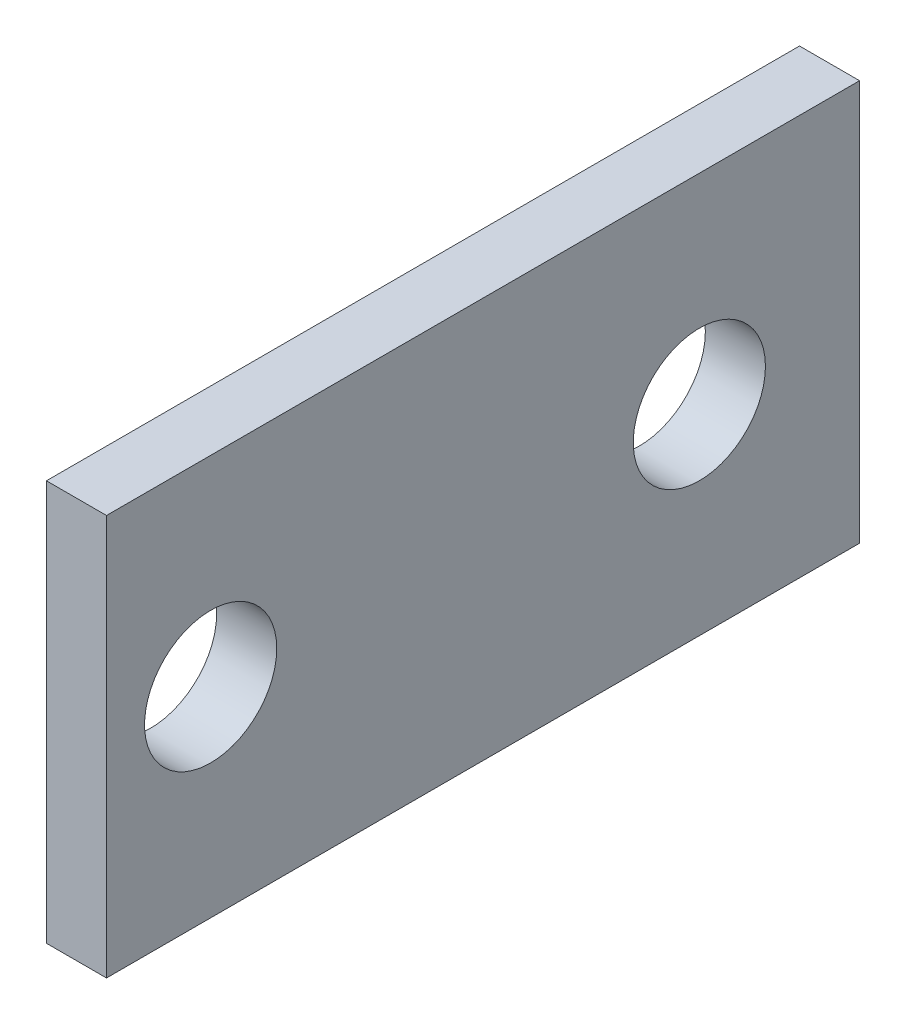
ISO-10303-21;
HEADER;
FILE_DESCRIPTION(('STEP AP214'),'2;1');
FILE_NAME('part.step','',(''),(''),'','','');
FILE_SCHEMA(('AUTOMOTIVE_DESIGN { 1 0 10303 214 1 1 1 1 }'));
ENDSEC;
DATA;
#1=APPLICATION_CONTEXT('core data for automotive mechanical design processes');
#2=APPLICATION_PROTOCOL_DEFINITION('international standard','automotive_design',2000,#1);
#3=PRODUCT_CONTEXT('',#1,'mechanical');
#4=PRODUCT('Part','Part','',(#3));
#5=PRODUCT_RELATED_PRODUCT_CATEGORY('part','',(#4));
#6=PRODUCT_DEFINITION_FORMATION('','',#4);
#7=PRODUCT_DEFINITION_CONTEXT('part definition',#1,'design');
#8=PRODUCT_DEFINITION('design','',#6,#7);
#9=PRODUCT_DEFINITION_SHAPE('','',#8);
#10=(LENGTH_UNIT() NAMED_UNIT(*) SI_UNIT(.MILLI.,.METRE.));
#11=(NAMED_UNIT(*) PLANE_ANGLE_UNIT() SI_UNIT($,.RADIAN.));
#12=(NAMED_UNIT(*) SI_UNIT($,.STERADIAN.) SOLID_ANGLE_UNIT());
#13=UNCERTAINTY_MEASURE_WITH_UNIT(LENGTH_MEASURE(1.E-05),#10,'distance_accuracy_value','');
#14=(GEOMETRIC_REPRESENTATION_CONTEXT(3) GLOBAL_UNCERTAINTY_ASSIGNED_CONTEXT((#13)) GLOBAL_UNIT_ASSIGNED_CONTEXT((#10,
#11,#12)) REPRESENTATION_CONTEXT('',''));
#15=CARTESIAN_POINT('',(0.,0.,0.));
#16=DIRECTION('',(0.,0.,1.));
#17=DIRECTION('',(1.,0.,0.));
#18=AXIS2_PLACEMENT_3D('',#15,#16,#17);
#19=CARTESIAN_POINT('',(1.5,0.,0.));
#20=DIRECTION('',(1.,0.,0.));
#21=DIRECTION('',(0.,0.,-1.));
#22=AXIS2_PLACEMENT_3D('',#19,#20,#21);
#23=PLANE('',#22);
#24=CARTESIAN_POINT('',(1.5,-3.49321550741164,15.0154963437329));
#25=DIRECTION('',(1.,0.,0.));
#26=DIRECTION('',(0.,0.,-1.));
#27=AXIS2_PLACEMENT_3D('',#24,#25,#26);
#28=CIRCLE('',#27,1.65);
#29=CARTESIAN_POINT('',(1.5,-3.49321550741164,13.3654963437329));
#30=VERTEX_POINT('',#29);
#31=EDGE_CURVE('E102',#30,#30,#28,.T.);
#32=ORIENTED_EDGE('',*,*,#31,.F.);
#33=EDGE_LOOP('',(#32));
#34=FACE_BOUND('',#33,.T.);
#35=DIRECTION('',(0.,-1.,0.));
#36=VECTOR('',#35,1.);
#37=CARTESIAN_POINT('',(1.5,1.50678449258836,17.6154963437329));
#38=LINE('',#37,#36);
#39=CARTESIAN_POINT('',(1.5,1.50678449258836,17.6154963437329));
#40=VERTEX_POINT('',#39);
#41=CARTESIAN_POINT('',(1.5,-8.49321550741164,17.6154963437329));
#42=VERTEX_POINT('',#41);
#43=EDGE_CURVE('E87',#40,#42,#38,.T.);
#44=ORIENTED_EDGE('',*,*,#43,.T.);
#45=DIRECTION('',(0.,0.,-1.));
#46=VECTOR('',#45,1.);
#47=CARTESIAN_POINT('',(1.5,-8.49321550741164,17.6154963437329));
#48=LINE('',#47,#46);
#49=CARTESIAN_POINT('',(1.5,-8.49321550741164,-1.18450365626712));
#50=VERTEX_POINT('',#49);
#51=EDGE_CURVE('E82',#42,#50,#48,.T.);
#52=ORIENTED_EDGE('',*,*,#51,.T.);
#53=DIRECTION('',(0.,1.,0.));
#54=VECTOR('',#53,1.);
#55=CARTESIAN_POINT('',(1.5,1.50678449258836,-1.18450365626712));
#56=LINE('',#55,#54);
#57=CARTESIAN_POINT('',(1.5,1.50678449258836,-1.18450365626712));
#58=VERTEX_POINT('',#57);
#59=EDGE_CURVE('E85',#50,#58,#56,.T.);
#60=ORIENTED_EDGE('',*,*,#59,.T.);
#61=DIRECTION('',(0.,0.,1.));
#62=VECTOR('',#61,1.);
#63=CARTESIAN_POINT('',(1.5,1.50678449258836,17.6154963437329));
#64=LINE('',#63,#62);
#65=EDGE_CURVE('E52',#58,#40,#64,.T.);
#66=ORIENTED_EDGE('',*,*,#65,.T.);
#67=EDGE_LOOP('',(#44,#52,#60,#66));
#68=FACE_BOUND('',#67,.T.);
#69=CARTESIAN_POINT('',(1.5,-3.49321550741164,2.81549634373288));
#70=DIRECTION('',(1.,0.,0.));
#71=DIRECTION('',(0.,0.,-1.));
#72=AXIS2_PLACEMENT_3D('',#69,#70,#71);
#73=CIRCLE('',#72,1.65);
#74=CARTESIAN_POINT('',(1.5,-3.49321550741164,1.16549634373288));
#75=VERTEX_POINT('',#74);
#76=EDGE_CURVE('E117',#75,#75,#73,.T.);
#77=ORIENTED_EDGE('',*,*,#76,.F.);
#78=EDGE_LOOP('',(#77));
#79=FACE_BOUND('',#78,.T.);
#80=ADVANCED_FACE('F35',(#34,#68,#79),#23,.T.);
#81=CARTESIAN_POINT('',(0.,0.,0.));
#82=DIRECTION('',(1.,0.,0.));
#83=DIRECTION('',(0.,0.,-1.));
#84=AXIS2_PLACEMENT_3D('',#81,#82,#83);
#85=PLANE('',#84);
#86=CARTESIAN_POINT('',(0.,-3.49321550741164,15.0154963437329));
#87=DIRECTION('',(1.,0.,0.));
#88=DIRECTION('',(0.,0.,-1.));
#89=AXIS2_PLACEMENT_3D('',#86,#87,#88);
#90=CIRCLE('',#89,1.65);
#91=CARTESIAN_POINT('',(0.,-3.49321550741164,13.3654963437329));
#92=VERTEX_POINT('',#91);
#93=EDGE_CURVE('E114',#92,#92,#90,.T.);
#94=ORIENTED_EDGE('',*,*,#93,.T.);
#95=EDGE_LOOP('',(#94));
#96=FACE_BOUND('',#95,.T.);
#97=DIRECTION('',(0.,-1.,0.));
#98=VECTOR('',#97,1.);
#99=CARTESIAN_POINT('',(0.,1.50678449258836,17.6154963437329));
#100=LINE('',#99,#98);
#101=CARTESIAN_POINT('',(0.,1.50678449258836,17.6154963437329));
#102=VERTEX_POINT('',#101);
#103=CARTESIAN_POINT('',(0.,-8.49321550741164,17.6154963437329));
#104=VERTEX_POINT('',#103);
#105=EDGE_CURVE('E99',#102,#104,#100,.T.);
#106=ORIENTED_EDGE('',*,*,#105,.F.);
#107=DIRECTION('',(0.,0.,1.));
#108=VECTOR('',#107,1.);
#109=CARTESIAN_POINT('',(0.,1.50678449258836,17.6154963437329));
#110=LINE('',#109,#108);
#111=CARTESIAN_POINT('',(0.,1.50678449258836,-1.18450365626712));
#112=VERTEX_POINT('',#111);
#113=EDGE_CURVE('E75',#112,#102,#110,.T.);
#114=ORIENTED_EDGE('',*,*,#113,.F.);
#115=DIRECTION('',(0.,1.,0.));
#116=VECTOR('',#115,1.);
#117=CARTESIAN_POINT('',(0.,1.50678449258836,-1.18450365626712));
#118=LINE('',#117,#116);
#119=CARTESIAN_POINT('',(0.,-8.49321550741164,-1.18450365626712));
#120=VERTEX_POINT('',#119);
#121=EDGE_CURVE('E69',#120,#112,#118,.T.);
#122=ORIENTED_EDGE('',*,*,#121,.F.);
#123=DIRECTION('',(0.,0.,-1.));
#124=VECTOR('',#123,1.);
#125=CARTESIAN_POINT('',(0.,-8.49321550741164,17.6154963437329));
#126=LINE('',#125,#124);
#127=EDGE_CURVE('E91',#104,#120,#126,.T.);
#128=ORIENTED_EDGE('',*,*,#127,.F.);
#129=EDGE_LOOP('',(#106,#114,#122,#128));
#130=FACE_BOUND('',#129,.T.);
#131=CARTESIAN_POINT('',(0.,-3.49321550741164,2.81549634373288));
#132=DIRECTION('',(1.,0.,0.));
#133=DIRECTION('',(0.,0.,-1.));
#134=AXIS2_PLACEMENT_3D('',#131,#132,#133);
#135=CIRCLE('',#134,1.65);
#136=CARTESIAN_POINT('',(0.,-3.49321550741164,1.16549634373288));
#137=VERTEX_POINT('',#136);
#138=EDGE_CURVE('E120',#137,#137,#135,.T.);
#139=ORIENTED_EDGE('',*,*,#138,.T.);
#140=EDGE_LOOP('',(#139));
#141=FACE_BOUND('',#140,.T.);
#142=ADVANCED_FACE('F110',(#96,#130,#141),#85,.F.);
#143=CARTESIAN_POINT('',(1.5,1.50678449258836,17.6154963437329));
#144=DIRECTION('',(0.,0.,-1.));
#145=DIRECTION('',(0.,1.,0.));
#146=AXIS2_PLACEMENT_3D('',#143,#144,#145);
#147=PLANE('',#146);
#148=ORIENTED_EDGE('',*,*,#105,.T.);
#149=DIRECTION('',(-1.,0.,0.));
#150=VECTOR('',#149,1.);
#151=CARTESIAN_POINT('',(1.5,-8.49321550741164,17.6154963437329));
#152=LINE('',#151,#150);
#153=EDGE_CURVE('E11',#42,#104,#152,.T.);
#154=ORIENTED_EDGE('',*,*,#153,.F.);
#155=ORIENTED_EDGE('',*,*,#43,.F.);
#156=DIRECTION('',(-1.,0.,0.));
#157=VECTOR('',#156,1.);
#158=CARTESIAN_POINT('',(1.5,1.50678449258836,17.6154963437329));
#159=LINE('',#158,#157);
#160=EDGE_CURVE('E95',#40,#102,#159,.T.);
#161=ORIENTED_EDGE('',*,*,#160,.T.);
#162=EDGE_LOOP('',(#148,#154,#155,#161));
#163=FACE_BOUND('',#162,.T.);
#164=ADVANCED_FACE('F37',(#163),#147,.F.);
#165=CARTESIAN_POINT('',(1.5,-8.49321550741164,17.6154963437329));
#166=DIRECTION('',(0.,1.,0.));
#167=DIRECTION('',(0.,0.,1.));
#168=AXIS2_PLACEMENT_3D('',#165,#166,#167);
#169=PLANE('',#168);
#170=ORIENTED_EDGE('',*,*,#127,.T.);
#171=DIRECTION('',(-1.,0.,0.));
#172=VECTOR('',#171,1.);
#173=CARTESIAN_POINT('',(1.5,-8.49321550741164,-1.18450365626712));
#174=LINE('',#173,#172);
#175=EDGE_CURVE('E44',#50,#120,#174,.T.);
#176=ORIENTED_EDGE('',*,*,#175,.F.);
#177=ORIENTED_EDGE('',*,*,#51,.F.);
#178=ORIENTED_EDGE('',*,*,#153,.T.);
#179=EDGE_LOOP('',(#170,#176,#177,#178));
#180=FACE_BOUND('',#179,.T.);
#181=ADVANCED_FACE('F90',(#180),#169,.F.);
#182=CARTESIAN_POINT('',(1.5,1.50678449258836,-1.18450365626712));
#183=DIRECTION('',(0.,0.,1.));
#184=DIRECTION('',(1.,0.,0.));
#185=AXIS2_PLACEMENT_3D('',#182,#183,#184);
#186=PLANE('',#185);
#187=ORIENTED_EDGE('',*,*,#121,.T.);
#188=DIRECTION('',(-1.,0.,0.));
#189=VECTOR('',#188,1.);
#190=CARTESIAN_POINT('',(1.5,1.50678449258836,-1.18450365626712));
#191=LINE('',#190,#189);
#192=EDGE_CURVE('E92',#58,#112,#191,.T.);
#193=ORIENTED_EDGE('',*,*,#192,.F.);
#194=ORIENTED_EDGE('',*,*,#59,.F.);
#195=ORIENTED_EDGE('',*,*,#175,.T.);
#196=EDGE_LOOP('',(#187,#193,#194,#195));
#197=FACE_BOUND('',#196,.T.);
#198=ADVANCED_FACE('F93',(#197),#186,.F.);
#199=CARTESIAN_POINT('',(1.5,1.50678449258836,17.6154963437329));
#200=DIRECTION('',(0.,-1.,0.));
#201=DIRECTION('',(0.,0.,-1.));
#202=AXIS2_PLACEMENT_3D('',#199,#200,#201);
#203=PLANE('',#202);
#204=ORIENTED_EDGE('',*,*,#113,.T.);
#205=ORIENTED_EDGE('',*,*,#160,.F.);
#206=ORIENTED_EDGE('',*,*,#65,.F.);
#207=ORIENTED_EDGE('',*,*,#192,.T.);
#208=EDGE_LOOP('',(#204,#205,#206,#207));
#209=FACE_BOUND('',#208,.T.);
#210=ADVANCED_FACE('F107',(#209),#203,.F.);
#211=CARTESIAN_POINT('',(1.5,-3.49321550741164,15.0154963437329));
#212=DIRECTION('',(-1.,0.,0.));
#213=DIRECTION('',(0.,0.,1.));
#214=AXIS2_PLACEMENT_3D('',#211,#212,#213);
#215=CYLINDRICAL_SURFACE('',#214,1.65);
#216=ORIENTED_EDGE('',*,*,#31,.T.);
#217=EDGE_LOOP('',(#216));
#218=FACE_BOUND('',#217,.T.);
#219=ORIENTED_EDGE('',*,*,#93,.F.);
#220=EDGE_LOOP('',(#219));
#221=FACE_BOUND('',#220,.T.);
#222=ADVANCED_FACE('F138',(#218,#221),#215,.F.);
#223=CARTESIAN_POINT('',(1.5,-3.49321550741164,2.81549634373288));
#224=DIRECTION('',(-1.,0.,0.));
#225=DIRECTION('',(0.,0.,1.));
#226=AXIS2_PLACEMENT_3D('',#223,#224,#225);
#227=CYLINDRICAL_SURFACE('',#226,1.65);
#228=ORIENTED_EDGE('',*,*,#76,.T.);
#229=EDGE_LOOP('',(#228));
#230=FACE_BOUND('',#229,.T.);
#231=ORIENTED_EDGE('',*,*,#138,.F.);
#232=EDGE_LOOP('',(#231));
#233=FACE_BOUND('',#232,.T.);
#234=ADVANCED_FACE('F126',(#230,#233),#227,.F.);
#235=CLOSED_SHELL('',(#80,#142,#164,#181,#198,#210,#222,#234));
#236=MANIFOLD_SOLID_BREP('B2',#235);
#237=ADVANCED_BREP_SHAPE_REPRESENTATION('',(#18,#236),#14);
#238=SHAPE_DEFINITION_REPRESENTATION(#9,#237);
ENDSEC;
END-ISO-10303-21;
